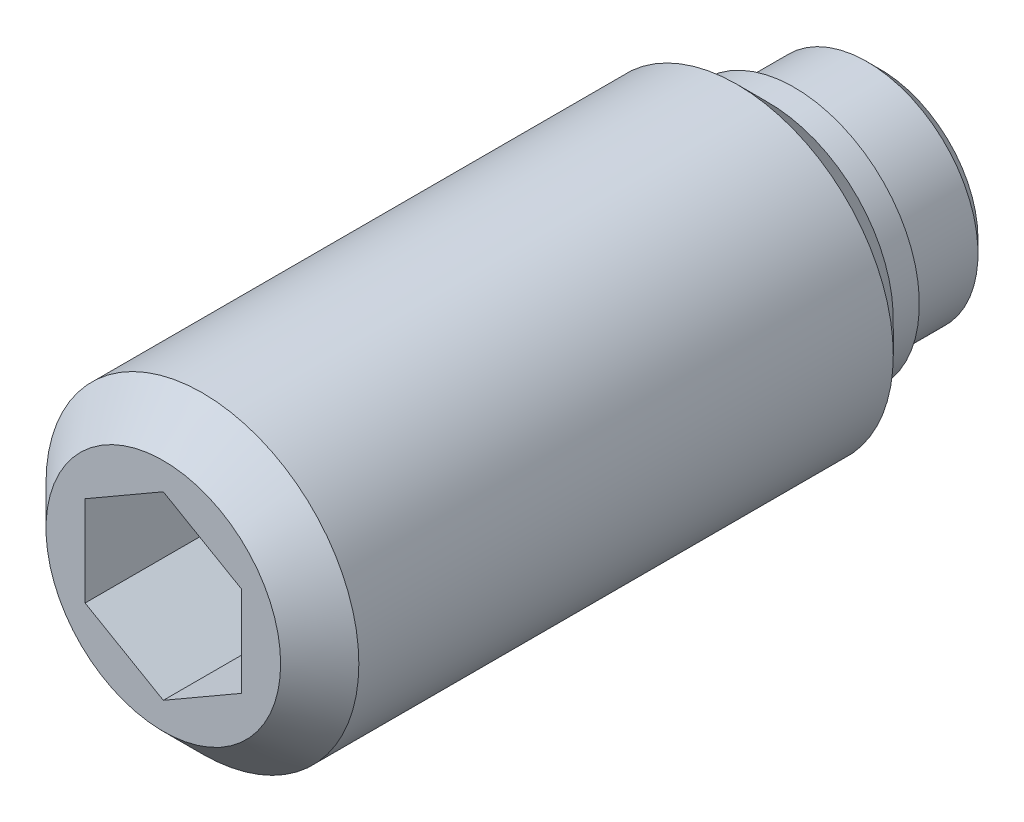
ISO-10303-21;
HEADER;
FILE_DESCRIPTION(('STEP AP214'),'2;1');
FILE_NAME('part.step','',(''),(''),'','','');
FILE_SCHEMA(('AUTOMOTIVE_DESIGN { 1 0 10303 214 1 1 1 1 }'));
ENDSEC;
DATA;
#1=APPLICATION_CONTEXT('core data for automotive mechanical design processes');
#2=APPLICATION_PROTOCOL_DEFINITION('international standard','automotive_design',2000,#1);
#3=PRODUCT_CONTEXT('',#1,'mechanical');
#4=PRODUCT('Part','Part','',(#3));
#5=PRODUCT_RELATED_PRODUCT_CATEGORY('part','',(#4));
#6=PRODUCT_DEFINITION_FORMATION('','',#4);
#7=PRODUCT_DEFINITION_CONTEXT('part definition',#1,'design');
#8=PRODUCT_DEFINITION('design','',#6,#7);
#9=PRODUCT_DEFINITION_SHAPE('','',#8);
#10=(LENGTH_UNIT() NAMED_UNIT(*) SI_UNIT(.MILLI.,.METRE.));
#11=(NAMED_UNIT(*) PLANE_ANGLE_UNIT() SI_UNIT($,.RADIAN.));
#12=(NAMED_UNIT(*) SI_UNIT($,.STERADIAN.) SOLID_ANGLE_UNIT());
#13=UNCERTAINTY_MEASURE_WITH_UNIT(LENGTH_MEASURE(1.E-05),#10,'distance_accuracy_value','');
#14=(GEOMETRIC_REPRESENTATION_CONTEXT(3) GLOBAL_UNCERTAINTY_ASSIGNED_CONTEXT((#13)) GLOBAL_UNIT_ASSIGNED_CONTEXT((#10,
#11,#12)) REPRESENTATION_CONTEXT('',''));
#15=CARTESIAN_POINT('',(0.,0.,0.));
#16=DIRECTION('',(0.,0.,1.));
#17=DIRECTION('',(1.,0.,0.));
#18=AXIS2_PLACEMENT_3D('',#15,#16,#17);
#19=CARTESIAN_POINT('',(0.,0.,3.3));
#20=DIRECTION('',(0.,0.,-1.));
#21=DIRECTION('',(-1.,0.,0.));
#22=AXIS2_PLACEMENT_3D('',#19,#20,#21);
#23=CYLINDRICAL_SURFACE('',#22,6.);
#24=CARTESIAN_POINT('',(0.,0.,26.));
#25=DIRECTION('',(0.,0.,1.));
#26=DIRECTION('',(1.,0.,0.));
#27=AXIS2_PLACEMENT_3D('',#24,#25,#26);
#28=CIRCLE('',#27,6.);
#29=CARTESIAN_POINT('',(6.,0.,26.));
#30=VERTEX_POINT('',#29);
#31=EDGE_CURVE('E9',#30,#30,#28,.F.);
#32=ORIENTED_EDGE('',*,*,#31,.T.);
#33=EDGE_LOOP('',(#32));
#34=FACE_BOUND('',#33,.T.);
#35=CARTESIAN_POINT('',(0.,0.,5.5));
#36=DIRECTION('',(0.,0.,-1.));
#37=DIRECTION('',(-1.,0.,0.));
#38=AXIS2_PLACEMENT_3D('',#35,#36,#37);
#39=CIRCLE('',#38,6.);
#40=CARTESIAN_POINT('',(-6.,0.,5.5));
#41=VERTEX_POINT('',#40);
#42=EDGE_CURVE('E74',#41,#41,#39,.T.);
#43=ORIENTED_EDGE('',*,*,#42,.F.);
#44=EDGE_LOOP('',(#43));
#45=FACE_BOUND('',#44,.T.);
#46=ADVANCED_FACE('F14',(#34,#45),#23,.T.);
#47=CARTESIAN_POINT('',(0.,0.,5.5));
#48=DIRECTION('',(0.,0.,1.));
#49=DIRECTION('',(1.,0.,0.));
#50=AXIS2_PLACEMENT_3D('',#47,#48,#49);
#51=CONICAL_SURFACE('',#50,6.,0.785398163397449);
#52=ORIENTED_EDGE('',*,*,#42,.T.);
#53=EDGE_LOOP('',(#52));
#54=FACE_BOUND('',#53,.T.);
#55=CARTESIAN_POINT('',(0.,0.,4.3));
#56=DIRECTION('',(0.,0.,-1.));
#57=DIRECTION('',(-1.,0.,0.));
#58=AXIS2_PLACEMENT_3D('',#55,#56,#57);
#59=CIRCLE('',#58,4.8);
#60=CARTESIAN_POINT('',(-4.8,0.,4.3));
#61=VERTEX_POINT('',#60);
#62=EDGE_CURVE('E112',#61,#61,#59,.T.);
#63=ORIENTED_EDGE('',*,*,#62,.F.);
#64=EDGE_LOOP('',(#63));
#65=FACE_BOUND('',#64,.T.);
#66=ADVANCED_FACE('F130',(#54,#65),#51,.T.);
#67=CARTESIAN_POINT('',(0.,0.,3.3));
#68=DIRECTION('',(0.,0.,-1.));
#69=DIRECTION('',(-1.,0.,0.));
#70=AXIS2_PLACEMENT_3D('',#67,#68,#69);
#71=CYLINDRICAL_SURFACE('',#70,4.8);
#72=ORIENTED_EDGE('',*,*,#62,.T.);
#73=EDGE_LOOP('',(#72));
#74=FACE_BOUND('',#73,.T.);
#75=CARTESIAN_POINT('',(0.,0.,3.3));
#76=DIRECTION('',(0.,0.,-1.));
#77=DIRECTION('',(-1.,0.,0.));
#78=AXIS2_PLACEMENT_3D('',#75,#76,#77);
#79=CIRCLE('',#78,4.8);
#80=CARTESIAN_POINT('',(-4.8,0.,3.3));
#81=VERTEX_POINT('',#80);
#82=EDGE_CURVE('E109',#81,#81,#79,.T.);
#83=ORIENTED_EDGE('',*,*,#82,.F.);
#84=EDGE_LOOP('',(#83));
#85=FACE_BOUND('',#84,.T.);
#86=ADVANCED_FACE('F135',(#74,#85),#71,.T.);
#87=CARTESIAN_POINT('',(0.,4.8,3.3));
#88=DIRECTION('',(0.,0.,1.));
#89=DIRECTION('',(1.,0.,0.));
#90=AXIS2_PLACEMENT_3D('',#87,#88,#89);
#91=PLANE('',#90);
#92=ORIENTED_EDGE('',*,*,#82,.T.);
#93=EDGE_LOOP('',(#92));
#94=FACE_BOUND('',#93,.T.);
#95=CARTESIAN_POINT('',(0.,0.,3.3));
#96=DIRECTION('',(0.,0.,-1.));
#97=DIRECTION('',(-1.,0.,0.));
#98=AXIS2_PLACEMENT_3D('',#95,#96,#97);
#99=CIRCLE('',#98,4.25);
#100=CARTESIAN_POINT('',(-4.25,0.,3.3));
#101=VERTEX_POINT('',#100);
#102=EDGE_CURVE('E106',#101,#101,#99,.T.);
#103=ORIENTED_EDGE('',*,*,#102,.F.);
#104=EDGE_LOOP('',(#103));
#105=FACE_BOUND('',#104,.T.);
#106=ADVANCED_FACE('F142',(#94,#105),#91,.F.);
#107=CARTESIAN_POINT('',(0.,0.,0.));
#108=DIRECTION('',(0.,0.,-1.));
#109=DIRECTION('',(-1.,0.,0.));
#110=AXIS2_PLACEMENT_3D('',#107,#108,#109);
#111=CYLINDRICAL_SURFACE('',#110,4.25);
#112=CARTESIAN_POINT('',(0.,0.,0.5));
#113=DIRECTION('',(0.,0.,-1.));
#114=DIRECTION('',(-1.,0.,0.));
#115=AXIS2_PLACEMENT_3D('',#112,#113,#114);
#116=CIRCLE('',#115,4.25);
#117=CARTESIAN_POINT('',(-4.25,0.,0.5));
#118=VERTEX_POINT('',#117);
#119=EDGE_CURVE('E103',#118,#118,#116,.T.);
#120=ORIENTED_EDGE('',*,*,#119,.F.);
#121=EDGE_LOOP('',(#120));
#122=FACE_BOUND('',#121,.T.);
#123=ORIENTED_EDGE('',*,*,#102,.T.);
#124=EDGE_LOOP('',(#123));
#125=FACE_BOUND('',#124,.T.);
#126=ADVANCED_FACE('F146',(#122,#125),#111,.T.);
#127=CARTESIAN_POINT('',(0.,0.,0.5));
#128=DIRECTION('',(0.,0.,1.));
#129=DIRECTION('',(1.,0.,0.));
#130=AXIS2_PLACEMENT_3D('',#127,#128,#129);
#131=CONICAL_SURFACE('',#130,4.25,0.785398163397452);
#132=CARTESIAN_POINT('',(0.,0.,0.));
#133=DIRECTION('',(0.,0.,-1.));
#134=DIRECTION('',(-1.,0.,0.));
#135=AXIS2_PLACEMENT_3D('',#132,#133,#134);
#136=CIRCLE('',#135,3.75);
#137=CARTESIAN_POINT('',(-3.75,0.,0.));
#138=VERTEX_POINT('',#137);
#139=EDGE_CURVE('E100',#138,#138,#136,.T.);
#140=ORIENTED_EDGE('',*,*,#139,.F.);
#141=EDGE_LOOP('',(#140));
#142=FACE_BOUND('',#141,.T.);
#143=ORIENTED_EDGE('',*,*,#119,.T.);
#144=EDGE_LOOP('',(#143));
#145=FACE_BOUND('',#144,.T.);
#146=ADVANCED_FACE('F150',(#142,#145),#131,.T.);
#147=CARTESIAN_POINT('',(0.,3.75,0.));
#148=DIRECTION('',(0.,0.,1.));
#149=DIRECTION('',(1.,0.,0.));
#150=AXIS2_PLACEMENT_3D('',#147,#148,#149);
#151=PLANE('',#150);
#152=ORIENTED_EDGE('',*,*,#139,.T.);
#153=EDGE_LOOP('',(#152));
#154=FACE_BOUND('',#153,.T.);
#155=ADVANCED_FACE('F154',(#154),#151,.F.);
#156=CARTESIAN_POINT('',(0.,0.,27.5));
#157=DIRECTION('',(0.,0.,1.));
#158=DIRECTION('',(1.,0.,0.));
#159=AXIS2_PLACEMENT_3D('',#156,#157,#158);
#160=PLANE('',#159);
#161=CARTESIAN_POINT('',(0.,0.,27.5));
#162=DIRECTION('',(0.,0.,1.));
#163=DIRECTION('',(1.,0.,0.));
#164=AXIS2_PLACEMENT_3D('',#161,#162,#163);
#165=CIRCLE('',#164,4.5);
#166=CARTESIAN_POINT('',(4.5,0.,27.5));
#167=VERTEX_POINT('',#166);
#168=EDGE_CURVE('E22',#167,#167,#165,.T.);
#169=ORIENTED_EDGE('',*,*,#168,.T.);
#170=EDGE_LOOP('',(#169));
#171=FACE_BOUND('',#170,.T.);
#172=DIRECTION('',(-0.866025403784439,0.5,0.));
#173=VECTOR('',#172,1.);
#174=CARTESIAN_POINT('',(-3.,-1.73205080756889,27.5));
#175=LINE('',#174,#173);
#176=CARTESIAN_POINT('',(0.,-3.46410161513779,27.5));
#177=VERTEX_POINT('',#176);
#178=CARTESIAN_POINT('',(-3.,-1.73205080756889,27.5));
#179=VERTEX_POINT('',#178);
#180=EDGE_CURVE('E69',#177,#179,#175,.T.);
#181=ORIENTED_EDGE('',*,*,#180,.T.);
#182=DIRECTION('',(0.,1.,0.));
#183=VECTOR('',#182,1.);
#184=CARTESIAN_POINT('',(-3.,1.73205080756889,27.5));
#185=LINE('',#184,#183);
#186=CARTESIAN_POINT('',(-3.,1.73205080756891,27.5));
#187=VERTEX_POINT('',#186);
#188=EDGE_CURVE('E84',#179,#187,#185,.T.);
#189=ORIENTED_EDGE('',*,*,#188,.T.);
#190=DIRECTION('',(0.866025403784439,0.5,0.));
#191=VECTOR('',#190,1.);
#192=CARTESIAN_POINT('',(0.,3.46410161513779,27.5));
#193=LINE('',#192,#191);
#194=CARTESIAN_POINT('',(0.,3.46410161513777,27.5));
#195=VERTEX_POINT('',#194);
#196=EDGE_CURVE('E301',#187,#195,#193,.T.);
#197=ORIENTED_EDGE('',*,*,#196,.T.);
#198=DIRECTION('',(0.866025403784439,-0.5,0.));
#199=VECTOR('',#198,1.);
#200=CARTESIAN_POINT('',(3.,1.73205080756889,27.5));
#201=LINE('',#200,#199);
#202=CARTESIAN_POINT('',(3.,1.73205080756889,27.5));
#203=VERTEX_POINT('',#202);
#204=EDGE_CURVE('E298',#195,#203,#201,.T.);
#205=ORIENTED_EDGE('',*,*,#204,.T.);
#206=DIRECTION('',(0.,-1.,0.));
#207=VECTOR('',#206,1.);
#208=CARTESIAN_POINT('',(3.,-1.73205080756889,27.5));
#209=LINE('',#208,#207);
#210=CARTESIAN_POINT('',(3.,-1.73205080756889,27.5));
#211=VERTEX_POINT('',#210);
#212=EDGE_CURVE('E29',#203,#211,#209,.T.);
#213=ORIENTED_EDGE('',*,*,#212,.T.);
#214=DIRECTION('',(-0.866025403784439,-0.5,0.));
#215=VECTOR('',#214,1.);
#216=CARTESIAN_POINT('',(0.,-3.46410161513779,27.5));
#217=LINE('',#216,#215);
#218=EDGE_CURVE('E66',#211,#177,#217,.T.);
#219=ORIENTED_EDGE('',*,*,#218,.T.);
#220=EDGE_LOOP('',(#181,#189,#197,#205,#213,#219));
#221=FACE_BOUND('',#220,.T.);
#222=ADVANCED_FACE('F68',(#171,#221),#160,.T.);
#223=CARTESIAN_POINT('',(0.,0.,19.5));
#224=DIRECTION('',(0.,0.,1.));
#225=DIRECTION('',(1.,0.,0.));
#226=AXIS2_PLACEMENT_3D('',#223,#224,#225);
#227=PLANE('',#226);
#228=DIRECTION('',(0.,-1.,0.));
#229=VECTOR('',#228,1.);
#230=CARTESIAN_POINT('',(-3.,1.73205080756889,19.5));
#231=LINE('',#230,#229);
#232=CARTESIAN_POINT('',(-3.,1.73205080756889,19.5));
#233=VERTEX_POINT('',#232);
#234=CARTESIAN_POINT('',(-3.,-1.73205080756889,19.5));
#235=VERTEX_POINT('',#234);
#236=EDGE_CURVE('E83',#233,#235,#231,.T.);
#237=ORIENTED_EDGE('',*,*,#236,.T.);
#238=DIRECTION('',(0.866025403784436,-0.5,0.));
#239=VECTOR('',#238,1.);
#240=CARTESIAN_POINT('',(-3.,-1.73205080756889,19.5));
#241=LINE('',#240,#239);
#242=CARTESIAN_POINT('',(0.,-3.46410161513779,19.5));
#243=VERTEX_POINT('',#242);
#244=EDGE_CURVE('E280',#235,#243,#241,.T.);
#245=ORIENTED_EDGE('',*,*,#244,.T.);
#246=DIRECTION('',(0.866025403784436,0.5,0.));
#247=VECTOR('',#246,1.);
#248=CARTESIAN_POINT('',(0.,-3.46410161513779,19.5));
#249=LINE('',#248,#247);
#250=CARTESIAN_POINT('',(3.,-1.73205080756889,19.5));
#251=VERTEX_POINT('',#250);
#252=EDGE_CURVE('E88',#243,#251,#249,.T.);
#253=ORIENTED_EDGE('',*,*,#252,.T.);
#254=DIRECTION('',(0.,1.,0.));
#255=VECTOR('',#254,1.);
#256=CARTESIAN_POINT('',(3.,-1.73205080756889,19.5));
#257=LINE('',#256,#255);
#258=CARTESIAN_POINT('',(3.,1.73205080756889,19.5));
#259=VERTEX_POINT('',#258);
#260=EDGE_CURVE('E287',#251,#259,#257,.T.);
#261=ORIENTED_EDGE('',*,*,#260,.T.);
#262=DIRECTION('',(-0.866025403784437,0.5,0.));
#263=VECTOR('',#262,1.);
#264=CARTESIAN_POINT('',(3.,1.73205080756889,19.5));
#265=LINE('',#264,#263);
#266=CARTESIAN_POINT('',(0.,3.46410161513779,19.5));
#267=VERTEX_POINT('',#266);
#268=EDGE_CURVE('E96',#259,#267,#265,.T.);
#269=ORIENTED_EDGE('',*,*,#268,.T.);
#270=DIRECTION('',(-0.866025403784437,-0.5,0.));
#271=VECTOR('',#270,1.);
#272=CARTESIAN_POINT('',(0.,3.46410161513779,19.5));
#273=LINE('',#272,#271);
#274=EDGE_CURVE('E91',#267,#233,#273,.T.);
#275=ORIENTED_EDGE('',*,*,#274,.T.);
#276=EDGE_LOOP('',(#237,#245,#253,#261,#269,#275));
#277=FACE_BOUND('',#276,.T.);
#278=ADVANCED_FACE('F162',(#277),#227,.T.);
#279=CARTESIAN_POINT('',(0.,-3.46410161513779,24.5));
#280=DIRECTION('',(0.5,-0.866025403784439,0.));
#281=DIRECTION('',(0.866025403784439,0.5,0.));
#282=AXIS2_PLACEMENT_3D('',#279,#280,#281);
#283=PLANE('',#282);
#284=ORIENTED_EDGE('',*,*,#218,.F.);
#285=DIRECTION('',(0.,0.,1.));
#286=VECTOR('',#285,1.);
#287=CARTESIAN_POINT('',(3.,-1.73205080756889,24.5));
#288=LINE('',#287,#286);
#289=EDGE_CURVE('E90',#251,#211,#288,.T.);
#290=ORIENTED_EDGE('',*,*,#289,.F.);
#291=ORIENTED_EDGE('',*,*,#252,.F.);
#292=DIRECTION('',(0.,0.,1.));
#293=VECTOR('',#292,1.);
#294=CARTESIAN_POINT('',(0.,-3.46410161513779,24.5));
#295=LINE('',#294,#293);
#296=EDGE_CURVE('E80',#243,#177,#295,.T.);
#297=ORIENTED_EDGE('',*,*,#296,.T.);
#298=EDGE_LOOP('',(#284,#290,#291,#297));
#299=FACE_BOUND('',#298,.T.);
#300=ADVANCED_FACE('F86',(#299),#283,.F.);
#301=CARTESIAN_POINT('',(3.,-1.73205080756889,24.5));
#302=DIRECTION('',(1.,0.,0.));
#303=DIRECTION('',(0.,0.,-1.));
#304=AXIS2_PLACEMENT_3D('',#301,#302,#303);
#305=PLANE('',#304);
#306=ORIENTED_EDGE('',*,*,#212,.F.);
#307=DIRECTION('',(0.,0.,1.));
#308=VECTOR('',#307,1.);
#309=CARTESIAN_POINT('',(3.,1.73205080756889,24.5));
#310=LINE('',#309,#308);
#311=EDGE_CURVE('E93',#259,#203,#310,.T.);
#312=ORIENTED_EDGE('',*,*,#311,.F.);
#313=ORIENTED_EDGE('',*,*,#260,.F.);
#314=ORIENTED_EDGE('',*,*,#289,.T.);
#315=EDGE_LOOP('',(#306,#312,#313,#314));
#316=FACE_BOUND('',#315,.T.);
#317=ADVANCED_FACE('F161',(#316),#305,.F.);
#318=CARTESIAN_POINT('',(3.,1.73205080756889,24.5));
#319=DIRECTION('',(0.5,0.866025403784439,0.));
#320=DIRECTION('',(-0.866025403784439,0.5,0.));
#321=AXIS2_PLACEMENT_3D('',#318,#319,#320);
#322=PLANE('',#321);
#323=ORIENTED_EDGE('',*,*,#204,.F.);
#324=DIRECTION('',(0.,0.,1.));
#325=VECTOR('',#324,1.);
#326=CARTESIAN_POINT('',(0.,3.46410161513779,24.5));
#327=LINE('',#326,#325);
#328=EDGE_CURVE('E293',#267,#195,#327,.T.);
#329=ORIENTED_EDGE('',*,*,#328,.F.);
#330=ORIENTED_EDGE('',*,*,#268,.F.);
#331=ORIENTED_EDGE('',*,*,#311,.T.);
#332=EDGE_LOOP('',(#323,#329,#330,#331));
#333=FACE_BOUND('',#332,.T.);
#334=ADVANCED_FACE('F165',(#333),#322,.F.);
#335=CARTESIAN_POINT('',(0.,3.46410161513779,24.5));
#336=DIRECTION('',(-0.5,0.866025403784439,0.));
#337=DIRECTION('',(-0.866025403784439,-0.5,0.));
#338=AXIS2_PLACEMENT_3D('',#335,#336,#337);
#339=PLANE('',#338);
#340=ORIENTED_EDGE('',*,*,#196,.F.);
#341=DIRECTION('',(0.,0.,1.));
#342=VECTOR('',#341,1.);
#343=CARTESIAN_POINT('',(-3.,1.73205080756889,24.5));
#344=LINE('',#343,#342);
#345=EDGE_CURVE('E37',#233,#187,#344,.T.);
#346=ORIENTED_EDGE('',*,*,#345,.F.);
#347=ORIENTED_EDGE('',*,*,#274,.F.);
#348=ORIENTED_EDGE('',*,*,#328,.T.);
#349=EDGE_LOOP('',(#340,#346,#347,#348));
#350=FACE_BOUND('',#349,.T.);
#351=ADVANCED_FACE('F169',(#350),#339,.F.);
#352=CARTESIAN_POINT('',(-3.,1.73205080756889,24.5));
#353=DIRECTION('',(-1.,0.,0.));
#354=DIRECTION('',(0.,0.,1.));
#355=AXIS2_PLACEMENT_3D('',#352,#353,#354);
#356=PLANE('',#355);
#357=ORIENTED_EDGE('',*,*,#188,.F.);
#358=DIRECTION('',(0.,0.,1.));
#359=VECTOR('',#358,1.);
#360=CARTESIAN_POINT('',(-3.,-1.73205080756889,24.5));
#361=LINE('',#360,#359);
#362=EDGE_CURVE('E82',#235,#179,#361,.T.);
#363=ORIENTED_EDGE('',*,*,#362,.F.);
#364=ORIENTED_EDGE('',*,*,#236,.F.);
#365=ORIENTED_EDGE('',*,*,#345,.T.);
#366=EDGE_LOOP('',(#357,#363,#364,#365));
#367=FACE_BOUND('',#366,.T.);
#368=ADVANCED_FACE('F126',(#367),#356,.F.);
#369=CARTESIAN_POINT('',(-3.,-1.73205080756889,24.5));
#370=DIRECTION('',(-0.5,-0.866025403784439,0.));
#371=DIRECTION('',(0.866025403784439,-0.5,0.));
#372=AXIS2_PLACEMENT_3D('',#369,#370,#371);
#373=PLANE('',#372);
#374=ORIENTED_EDGE('',*,*,#180,.F.);
#375=ORIENTED_EDGE('',*,*,#296,.F.);
#376=ORIENTED_EDGE('',*,*,#244,.F.);
#377=ORIENTED_EDGE('',*,*,#362,.T.);
#378=EDGE_LOOP('',(#374,#375,#376,#377));
#379=FACE_BOUND('',#378,.T.);
#380=ADVANCED_FACE('F78',(#379),#373,.F.);
#381=CARTESIAN_POINT('',(0.,0.,27.5));
#382=DIRECTION('',(0.,0.,-1.));
#383=DIRECTION('',(-1.,0.,0.));
#384=AXIS2_PLACEMENT_3D('',#381,#382,#383);
#385=CONICAL_SURFACE('',#384,4.5,0.785398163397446);
#386=ORIENTED_EDGE('',*,*,#31,.F.);
#387=EDGE_LOOP('',(#386));
#388=FACE_BOUND('',#387,.T.);
#389=ORIENTED_EDGE('',*,*,#168,.F.);
#390=EDGE_LOOP('',(#389));
#391=FACE_BOUND('',#390,.T.);
#392=ADVANCED_FACE('F16',(#388,#391),#385,.T.);
#393=CLOSED_SHELL('',(#46,#66,#86,#106,#126,#146,#155,#222,#278,#300,#317,#334,#351,#368,#380,#392));
#394=MANIFOLD_SOLID_BREP('B1',#393);
#395=ADVANCED_BREP_SHAPE_REPRESENTATION('',(#18,#394),#14);
#396=SHAPE_DEFINITION_REPRESENTATION(#9,#395);
ENDSEC;
END-ISO-10303-21;
